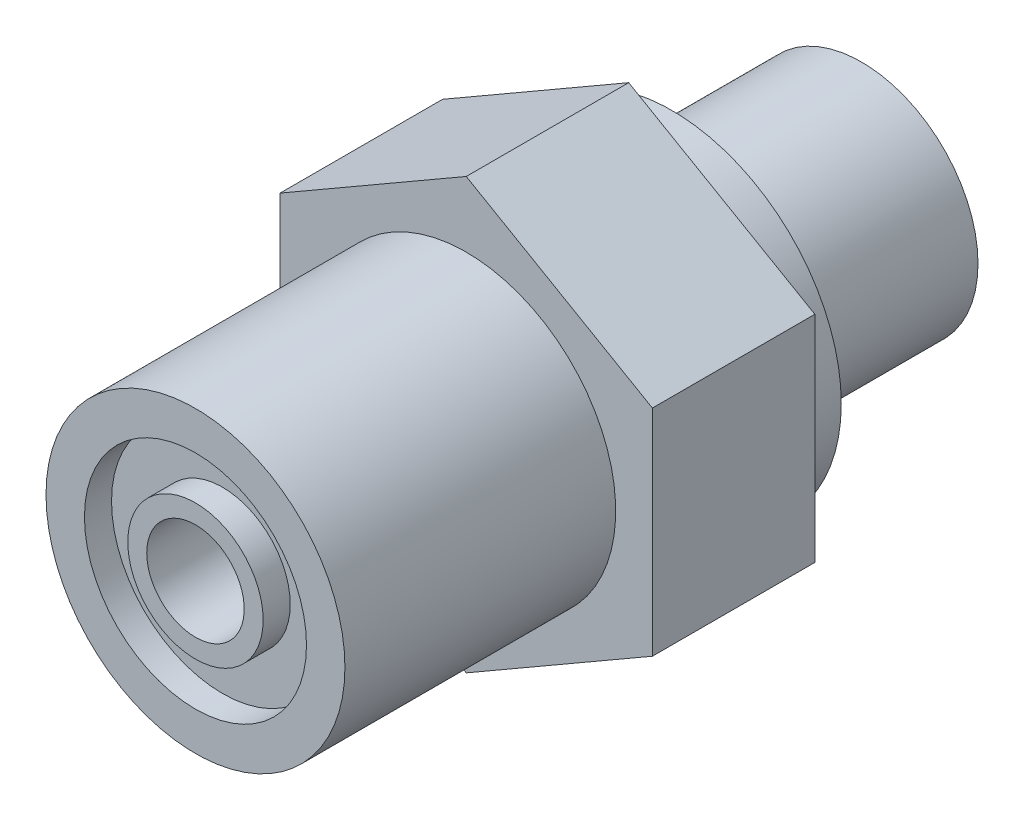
from build123d import *

# Parameters (mm, degrees)
SKETCH1_R           = 5.461
EXTRUDE1_DEPTH      = 8.89
SKETCH2_R           = 7.9375
EXTRUDE2_DEPTH      = 2.032
BOSS_EXTRUDE1_DEPTH = 7.62
SKETCH22_R          = 7.0104
EXTRUDE4_DEPTH      = 12.7
SKETCH23_R          = 2.286
CUT_EXTRUDE1_DEPTH  = 34.969743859
SKETCH24_R          = 5.207
SKETCH24_R_2        = 3.175
CUT_EXTRUDE2_DEPTH  = 1.27


with BuildPart() as part:
    # Sketch1 → Extrude1 (new body)
    with BuildSketch(Plane.XY):
        Circle(SKETCH1_R)
    extrude(amount=EXTRUDE1_DEPTH)

    # Sketch2 → Extrude2 (add)
    with BuildSketch(Plane.XY.offset(8.89)):
        Circle(SKETCH2_R)
    extrude(amount=EXTRUDE2_DEPTH)

    # Sketch21 → Boss-Extrude1 (add)
    with BuildSketch(Plane(origin=(1.524604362, -1.890509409, 10.922), x_dir=(1, 0, 0), z_dir=(0, 0, 1))):
        Polygon((7.206645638, 6.931496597), (7.206645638, -3.150477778), (-1.524600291, -8.191464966), (-10.25584622, -3.150477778), (-10.25584622, 6.931496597), (-1.524600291, 11.972483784), align=None)
    extrude(amount=BOSS_EXTRUDE1_DEPTH)

    # Sketch22 → Extrude4 (add)
    with BuildSketch(Plane.XY.offset(18.542)):
        with Locations(Location((0, 0, 0), (0, 0, 180))):
            Circle(SKETCH22_R)
    extrude(amount=EXTRUDE4_DEPTH)

    # Sketch23 → Cut-Extrude1 (cut, through all)
    with BuildSketch(Plane(origin=(0, 0, 0), x_dir=(-1, 0, 0), z_dir=(0, 0, -1))):
        Circle(SKETCH23_R)
    extrude(amount=-CUT_EXTRUDE1_DEPTH, mode=Mode.SUBTRACT)

    # Sketch24 → Cut-Extrude2 (cut)
    with BuildSketch(Plane.XY.offset(31.242)):
        Circle(SKETCH24_R)
        Circle(SKETCH24_R_2, mode=Mode.SUBTRACT)
    extrude(amount=-CUT_EXTRUDE2_DEPTH, mode=Mode.SUBTRACT)


solid = part.part
